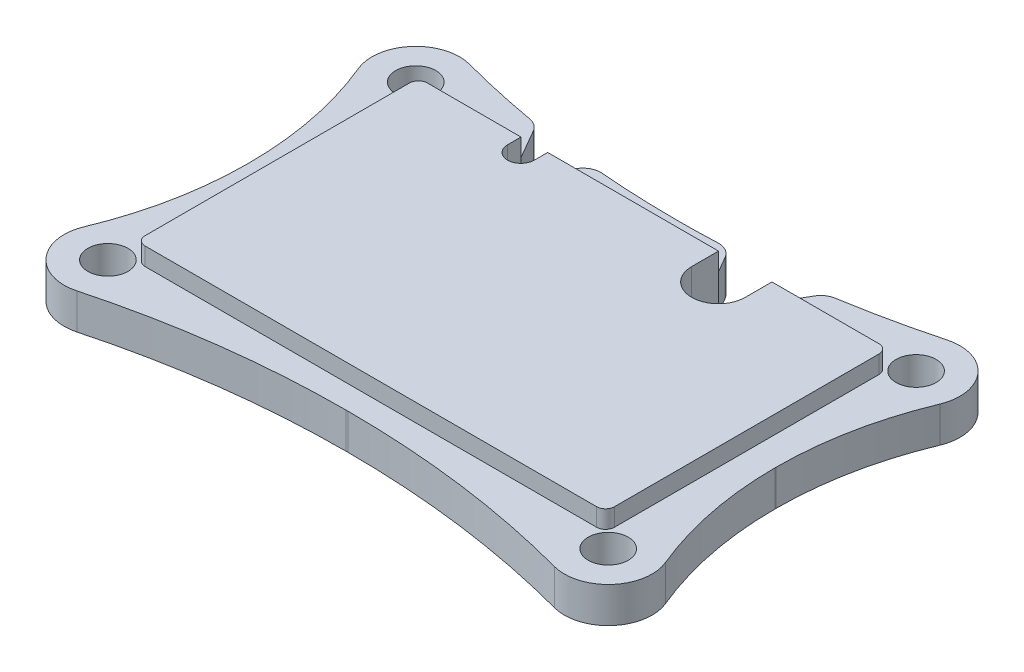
from build123d import *

# Parameters (mm, degrees)
SKETCH1_R           = 2.25
BOSS_EXTRUDE1_DEPTH = 4
FILLET1_R           = 40
FILLET2_R           = 103
BOSS_EXTRUDE2_DEPTH = 2
CUT_EXTRUDE1_DEPTH  = 51.69267462
FILLET8_R           = 2


with BuildPart() as part:
    # Sketch1 → Boss-Extrude1 (new body)
    with BuildSketch(Plane(origin=(0, 0, 0), x_dir=(1, 0, 0), z_dir=(0, 1, 0))):
        with BuildLine():
            Line((-29.56, 28.41642837), (-29.56, 3.25357163))
            ThreePointArc((-29.56, 3.25357163), (-31.446417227, -5.006638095), (-23.302108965, -2.67))
            Line((-23.302108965, -2.67), (23.302108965, -2.67))
            ThreePointArc((23.302108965, -2.67), (31.446417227, -5.006638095), (29.56, 3.25357163))
            Line((29.56, 3.25357163), (29.56, 28.41642837))
            ThreePointArc((29.56, 28.41642837), (31.446417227, 36.676638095), (23.302108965, 34.34))
            Line((23.302108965, 34.34), (-23.302108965, 34.34))
            ThreePointArc((-23.302108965, 34.34), (-31.446417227, 36.676638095), (-29.56, 28.41642837))
        make_face()
        with Locations(Location((-28.064205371, -1.433538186, 0), (0, 0, 270))):
            Circle(SKETCH1_R, mode=Mode.SUBTRACT)
        with Locations(Location((-28.064205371, 33.103538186, 0), (0, 0, 90))):
            Circle(SKETCH1_R, mode=Mode.SUBTRACT)
        with Locations(Location((28.064205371, 33.103538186, 0), (0, 0, 270))):
            Circle(SKETCH1_R, mode=Mode.SUBTRACT)
        with Locations(Location((28.064205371, -1.433538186, 0), (0, 0, 90))):
            Circle(SKETCH1_R, mode=Mode.SUBTRACT)
    extrude(amount=-BOSS_EXTRUDE1_DEPTH)

    # Fillet1
    fillet1_edges = [part.edges().sort_by_distance(p)[0] for p in [
        (-29.56, -2, -28.41642837),
        (-29.56, -2, -3.25357163),
        (29.56, -2, -3.25357163),
        (29.56, -2, -28.41642837),
    ]]
    fillet(fillet1_edges, radius=FILLET1_R)

    # Fillet2
    fillet2_edges = [part.edges().sort_by_distance(p)[0] for p in [
        (-23.302108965, -2, 2.67),
        (23.302108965, -2, 2.67),
        (23.302108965, -2, -34.34),
        (-23.302108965, -2, -34.34),
    ]]
    fillet(fillet2_edges, radius=FILLET2_R)

    # Sketch1_14 → Boss-Extrude2 (add)
    with BuildSketch(Plane(origin=(0, 0, 0), x_dir=(1, 0, 0), z_dir=(0, 1, 0))):
        with BuildLine():
            Line((-25.33, 0), (25.33, 0))
            ThreePointArc((25.33, 0), (26.037106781, 0.292893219), (26.33, 1))
            Line((26.33, 1), (26.33, 3.67))
            Line((26.33, 3.67), (26.33, 5.5))
            Line((26.33, 5.5), (26.33, 15.255))
            Line((26.33, 15.255), (26.33, 18.915))
            Line((26.33, 18.915), (26.33, 30.67))
            ThreePointArc((26.33, 30.67), (26.037106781, 31.377106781), (25.33, 31.67))
            Line((25.33, 31.67), (-25.33, 31.67))
            ThreePointArc((-25.33, 31.67), (-26.037106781, 31.377106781), (-26.33, 30.67))
            Line((-26.33, 30.67), (-26.33, 18.915))
            Line((-26.33, 18.915), (-26.33, 15.255))
            Line((-26.33, 15.255), (-26.33, 5.5))
            Line((-26.33, 5.5), (-26.33, 3.67))
            Line((-26.33, 3.67), (-26.33, 1))
            ThreePointArc((-26.33, 1), (-26.037106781, 0.292893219), (-25.33, 0))
        make_face()
    extrude(amount=BOSS_EXTRUDE2_DEPTH)

    # Sketch2 → Cut-Extrude1 (cut, through all)
    with BuildSketch(Plane(origin=(0, 2, 0), x_dir=(1, 0, 0), z_dir=(0, 1, 0))):
        with BuildLine():
            Line((-14.83, 30.17), (-14.83, 31.67))
            Line((-14.83, 31.67), (-19.522792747, 39.798155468))
            Line((-19.522792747, 39.798155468), (-7.137207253, 39.798155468))
            Line((-7.137207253, 39.798155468), (-11.83, 31.67))
            Line((-11.83, 31.67), (-11.83, 30.17))
            ThreePointArc((-11.83, 30.17), (-13.33, 28.67), (-14.83, 30.17))
        make_face()
        with BuildLine():
            Line((7.33, 28.67), (7.33, 31.67))
            Line((7.33, 31.67), (2.637207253, 39.798155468))
            Line((2.637207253, 39.798155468), (18.022792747, 39.798155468))
            Line((18.022792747, 39.798155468), (13.33, 31.67))
            Line((13.33, 31.67), (13.33, 28.67))
            ThreePointArc((13.33, 28.67), (10.33, 25.67), (7.33, 28.67))
        make_face()
    extrude(amount=-CUT_EXTRUDE1_DEPTH, mode=Mode.SUBTRACT)

    # Fillet8
    fillet8_edges = [part.edges().sort_by_distance(p)[0] for p in [
        (-17.195451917, -2, -35.767082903),
        (-10.01293523, -2, -34.817248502),
        (5.700780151, -2, -34.491891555),
        (15.542916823, -2, -35.502884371),
    ]]
    fillet(fillet8_edges, radius=FILLET8_R)


solid = part.part
